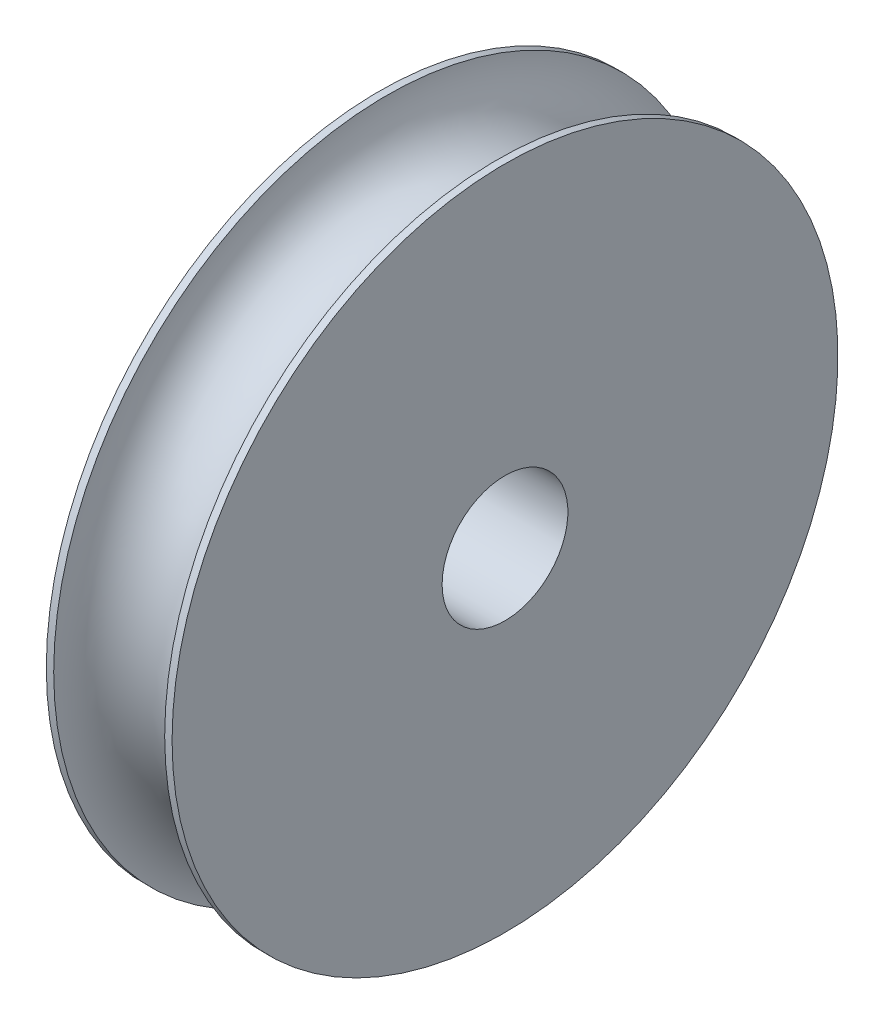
from build123d import *


with BuildPart() as part:
    # Esquisse1 → R_volution1 (revolve)
    with BuildSketch(Plane.XY, mode=Mode.PRIVATE) as r_volution1_sk:
        with BuildLine():
            Line((0, 17), (0, 90))
            Line((0, 90), (2, 90))
            ThreePointArc((2, 90), (17, 75), (32, 90))
            Line((32, 90), (34, 90))
            Line((34, 90), (34, 17))
            Line((34, 17), (0, 17))
        make_face()
    revolve(r_volution1_sk.sketch.rotate(Axis((0, 0, 0), (1, 0, 0)), 90), axis=Axis((0, 0, 0), (1, 0, 0)))


solid = part.part
